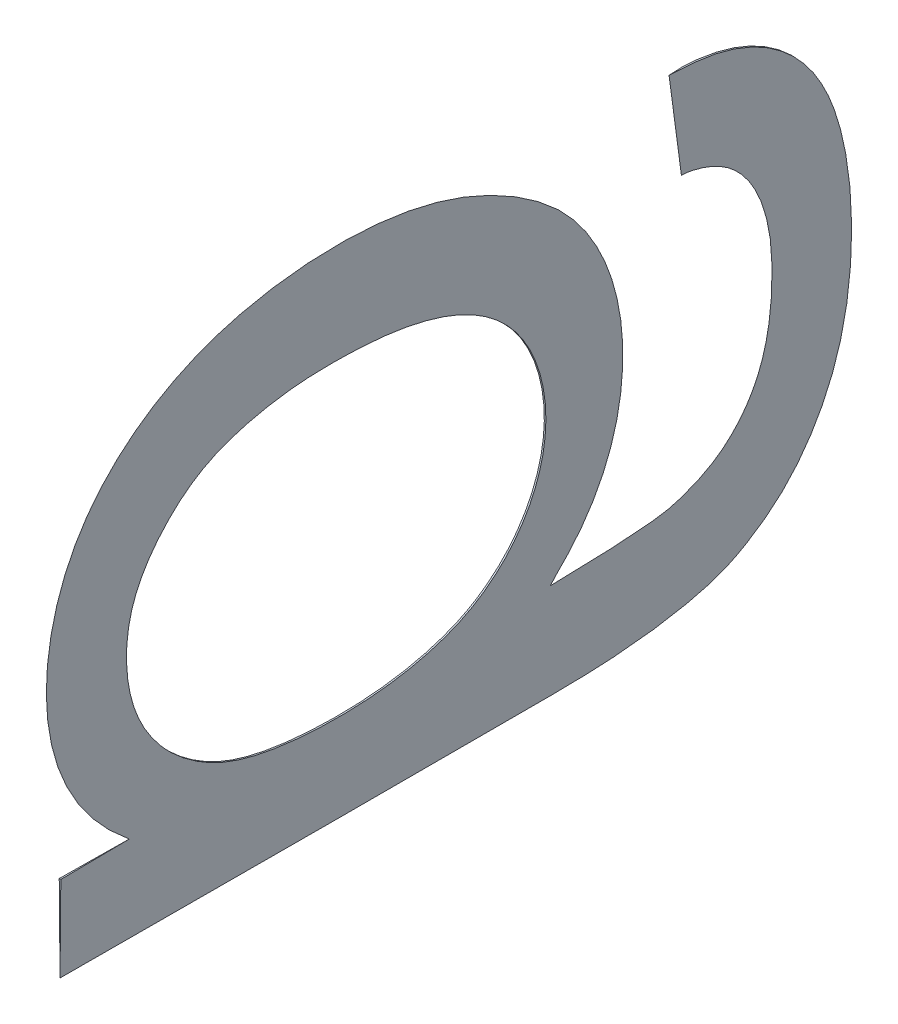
ISO-10303-21;
HEADER;
FILE_DESCRIPTION(('STEP AP214'),'2;1');
FILE_NAME('part.step','',(''),(''),'','','');
FILE_SCHEMA(('AUTOMOTIVE_DESIGN { 1 0 10303 214 1 1 1 1 }'));
ENDSEC;
DATA;
#1=APPLICATION_CONTEXT('core data for automotive mechanical design processes');
#2=APPLICATION_PROTOCOL_DEFINITION('international standard','automotive_design',2000,#1);
#3=PRODUCT_CONTEXT('',#1,'mechanical');
#4=PRODUCT('Part','Part','',(#3));
#5=PRODUCT_RELATED_PRODUCT_CATEGORY('part','',(#4));
#6=PRODUCT_DEFINITION_FORMATION('','',#4);
#7=PRODUCT_DEFINITION_CONTEXT('part definition',#1,'design');
#8=PRODUCT_DEFINITION('design','',#6,#7);
#9=PRODUCT_DEFINITION_SHAPE('','',#8);
#10=(LENGTH_UNIT() NAMED_UNIT(*) SI_UNIT(.MILLI.,.METRE.));
#11=(NAMED_UNIT(*) PLANE_ANGLE_UNIT() SI_UNIT($,.RADIAN.));
#12=(NAMED_UNIT(*) SI_UNIT($,.STERADIAN.) SOLID_ANGLE_UNIT());
#13=UNCERTAINTY_MEASURE_WITH_UNIT(LENGTH_MEASURE(1.E-05),#10,'distance_accuracy_value','');
#14=(GEOMETRIC_REPRESENTATION_CONTEXT(3) GLOBAL_UNCERTAINTY_ASSIGNED_CONTEXT((#13)) GLOBAL_UNIT_ASSIGNED_CONTEXT((#10,
#11,#12)) REPRESENTATION_CONTEXT('',''));
#15=CARTESIAN_POINT('',(0.,0.,0.));
#16=DIRECTION('',(0.,0.,1.));
#17=DIRECTION('',(1.,0.,0.));
#18=AXIS2_PLACEMENT_3D('',#15,#16,#17);
#19=CARTESIAN_POINT('',(-5.56,-17.74356913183,20.699035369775));
#20=DIRECTION('',(0.,0.,1.));
#21=DIRECTION('',(1.,0.,0.));
#22=AXIS2_PLACEMENT_3D('',#19,#20,#21);
#23=PLANE('',#22);
#24=DIRECTION('',(0.,-1.,0.));
#25=VECTOR('',#24,1.);
#26=CARTESIAN_POINT('',(-5.56,-18.17159628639,20.699035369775));
#27=LINE('',#26,#25);
#28=CARTESIAN_POINT('',(-5.555,-18.27733118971,20.699035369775));
#29=VERTEX_POINT('',#28);
#30=CARTESIAN_POINT('',(-5.56,-17.74356913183,20.699035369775));
#31=VERTEX_POINT('',#30);
#32=EDGE_CURVE('E69',#29,#31,#27,.F.);
#33=ORIENTED_EDGE('',*,*,#32,.F.);
#34=DIRECTION('',(0.,-1.,0.));
#35=VECTOR('',#34,1.);
#36=CARTESIAN_POINT('',(-5.55,-18.17159628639,20.699035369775));
#37=LINE('',#36,#35);
#38=CARTESIAN_POINT('',(-5.55,-17.74356913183,20.699035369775));
#39=VERTEX_POINT('',#38);
#40=EDGE_CURVE('E76',#29,#39,#37,.F.);
#41=ORIENTED_EDGE('',*,*,#40,.T.);
#42=DIRECTION('',(-1.,0.,0.));
#43=VECTOR('',#42,1.);
#44=CARTESIAN_POINT('',(-5.56,-17.74356913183,20.699035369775));
#45=LINE('',#44,#43);
#46=EDGE_CURVE('E61',#31,#39,#45,.F.);
#47=ORIENTED_EDGE('',*,*,#46,.F.);
#48=EDGE_LOOP('',(#33,#41,#47));
#49=FACE_BOUND('',#48,.T.);
#50=ADVANCED_FACE('F17',(#49),#23,.T.);
#51=CARTESIAN_POINT('',(-5.56,-17.74356913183,20.268167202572));
#52=DIRECTION('',(0.,1.,0.));
#53=DIRECTION('',(-1.,0.,0.));
#54=AXIS2_PLACEMENT_3D('',#51,#52,#53);
#55=PLANE('',#54);
#56=DIRECTION('',(0.,0.,1.));
#57=VECTOR('',#56,1.);
#58=CARTESIAN_POINT('',(-5.56,-17.74356913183,16.671244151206));
#59=LINE('',#58,#57);
#60=CARTESIAN_POINT('',(-5.555,-17.743569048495,20.268167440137));
#61=VERTEX_POINT('',#60);
#62=EDGE_CURVE('E65',#31,#61,#59,.F.);
#63=ORIENTED_EDGE('',*,*,#62,.F.);
#64=ORIENTED_EDGE('',*,*,#46,.T.);
#65=DIRECTION('',(0.,0.,1.));
#66=VECTOR('',#65,1.);
#67=CARTESIAN_POINT('',(-5.55,-17.74356913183,16.671244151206));
#68=LINE('',#67,#66);
#69=EDGE_CURVE('E64',#39,#61,#68,.F.);
#70=ORIENTED_EDGE('',*,*,#69,.T.);
#71=EDGE_LOOP('',(#63,#64,#70));
#72=FACE_BOUND('',#71,.T.);
#73=ADVANCED_FACE('F63',(#72),#55,.T.);
#74=CARTESIAN_POINT('',(-5.56,-18.17159628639,16.671244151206));
#75=DIRECTION('',(-1.,0.,0.));
#76=DIRECTION('',(0.,-1.,0.));
#77=AXIS2_PLACEMENT_3D('',#74,#75,#76);
#78=PLANE('',#77);
#79=CARTESIAN_POINT('',(-5.56,-15.80466237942,19.007717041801));
#80=CARTESIAN_POINT('',(-5.56,-15.80495361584,18.933886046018));
#81=CARTESIAN_POINT('',(-5.56,-15.81030044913,18.76349559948));
#82=CARTESIAN_POINT('',(-5.56,-15.84513349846,18.487718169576));
#83=CARTESIAN_POINT('',(-5.56,-15.96767723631,18.074812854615));
#84=CARTESIAN_POINT('',(-5.56,-16.31326125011,17.731029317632));
#85=CARTESIAN_POINT('',(-5.56,-16.89464924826,17.630038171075));
#86=CARTESIAN_POINT('',(-5.56,-17.30611635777,17.821288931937));
#87=CARTESIAN_POINT('',(-5.56,-17.52772728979,18.075624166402));
#88=CARTESIAN_POINT('',(-5.56,-17.66159816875,18.337160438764));
#89=CARTESIAN_POINT('',(-5.56,-17.75344367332,18.789555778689));
#90=CARTESIAN_POINT('',(-5.56,-17.71585651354,19.470448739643));
#91=CARTESIAN_POINT('',(-5.56,-17.57753857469,19.810563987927));
#92=CARTESIAN_POINT('',(-5.56,-17.37899507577,20.046874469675));
#93=CARTESIAN_POINT('',(-5.56,-17.14464117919,20.226509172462));
#94=CARTESIAN_POINT('',(-5.56,-16.81739554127,20.314702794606));
#95=CARTESIAN_POINT('',(-5.56,-16.41922193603,20.262414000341));
#96=CARTESIAN_POINT('',(-5.56,-16.0449736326,19.970849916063));
#97=CARTESIAN_POINT('',(-5.56,-15.8933812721,19.686814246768));
#98=CARTESIAN_POINT('',(-5.56,-15.81685638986,19.317723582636));
#99=CARTESIAN_POINT('',(-5.56,-15.80416898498,19.132796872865));
#100=CARTESIAN_POINT('',(-5.56,-15.80466237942,19.007717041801));
#101=B_SPLINE_CURVE_WITH_KNOTS('',3,(#79,#80,#81,#82,#83,#84,#85,#86,#87,#88,#89,#90,#91,#92,
#93,#94,#95,#96,#97,#98,#99,#100),.UNSPECIFIED.,.T.,.F.,(4,1,1,1,1,1,1,1,1,1,1,1,1,1,1,1,1,1,1,
4),(0.,0.02139258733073,0.04278517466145,0.08557034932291,0.171140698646,0.256711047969,
0.342281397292,0.378397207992,0.414513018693,0.486744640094,0.558976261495,0.631207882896,
0.660510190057,0.689812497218,0.748417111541,0.8017246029,0.855032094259,0.927516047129,
0.963758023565,1.),.UNSPECIFIED.);
#102=CARTESIAN_POINT('',(-5.56,-15.8047098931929,18.9986359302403));
#103=VERTEX_POINT('',#102);
#104=EDGE_CURVE('E83',#103,#103,#101,.T.);
#105=ORIENTED_EDGE('',*,*,#104,.F.);
#106=EDGE_LOOP('',(#105));
#107=FACE_BOUND('',#106,.T.);
#108=CARTESIAN_POINT('',(-5.56,-17.68890650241,17.647587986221));
#109=CARTESIAN_POINT('',(-5.56,-17.6889068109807,17.3973414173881));
#110=CARTESIAN_POINT('',(-5.56,-17.6814941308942,17.2402048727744));
#111=CARTESIAN_POINT('',(-5.56,-17.6690179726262,16.9757309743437));
#112=CARTESIAN_POINT('',(-5.56,-17.6402882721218,16.8751682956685));
#113=CARTESIAN_POINT('',(-5.56,-17.5855437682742,16.6835459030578));
#114=CARTESIAN_POINT('',(-5.56,-17.4869549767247,16.5630641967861));
#115=CARTESIAN_POINT('',(-5.56,-17.3806855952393,16.4331963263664));
#116=CARTESIAN_POINT('',(-5.56,-17.2263921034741,16.359913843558));
#117=CARTESIAN_POINT('',(-5.56,-17.0651673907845,16.2833393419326));
#118=CARTESIAN_POINT('',(-5.56,-16.833752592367,16.2665897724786));
#119=CARTESIAN_POINT('',(-5.56,-16.5657420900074,16.2471914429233));
#120=CARTESIAN_POINT('',(-5.56,-16.3709903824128,16.2999195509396));
#121=CARTESIAN_POINT('',(-5.56,-16.1561313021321,16.3580916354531));
#122=CARTESIAN_POINT('',(-5.56,-16.0321635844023,16.4894310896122));
#123=CARTESIAN_POINT('',(-5.56,-15.9112466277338,16.6175383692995));
#124=CARTESIAN_POINT('',(-5.56,-15.88504823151,16.830868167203));
#125=B_SPLINE_CURVE_WITH_KNOTS('',2,(#108,#109,#110,#111,#112,#113,#114,#115,#116,#117,#118,
#119,#120,#121,#122,#123,#124),.UNSPECIFIED.,.F.,.F.,(3,2,2,2,2,2,2,2,3),(0.,0.1,0.25,0.375,0.5,
0.625,0.75,0.875,1.),.UNSPECIFIED.);
#126=CARTESIAN_POINT('',(-5.555,-17.68890650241,17.647587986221));
#127=VERTEX_POINT('',#126);
#128=CARTESIAN_POINT('',(-5.555,-15.88504815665,16.8308680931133));
#129=VERTEX_POINT('',#128);
#130=EDGE_CURVE('E213',#127,#129,#125,.T.);
#131=ORIENTED_EDGE('',*,*,#130,.T.);
#132=DIRECTION('',(0.,-0.991227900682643,-0.132163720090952));
#133=VECTOR('',#132,1.);
#134=CARTESIAN_POINT('',(-5.56,-15.30627009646,16.908038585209));
#135=LINE('',#134,#133);
#136=CARTESIAN_POINT('',(-5.555,-15.3062700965,16.9080385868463));
#137=VERTEX_POINT('',#136);
#138=EDGE_CURVE('E43',#137,#129,#135,.T.);
#139=ORIENTED_EDGE('',*,*,#138,.F.);
#140=CARTESIAN_POINT('',(-5.56,-18.27733118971,20.699035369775));
#141=CARTESIAN_POINT('',(-5.56,-18.27733118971,20.368399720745));
#142=CARTESIAN_POINT('',(-5.56,-18.27734943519,19.707862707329));
#143=CARTESIAN_POINT('',(-5.56,-18.27728101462,18.878520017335));
#144=CARTESIAN_POINT('',(-5.56,-18.27740075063,18.30472637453));
#145=CARTESIAN_POINT('',(-5.56,-18.27720917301,17.966380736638));
#146=CARTESIAN_POINT('',(-5.56,-18.27779758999,17.742084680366));
#147=CARTESIAN_POINT('',(-5.56,-18.27558760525,17.405167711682));
#148=CARTESIAN_POINT('',(-5.56,-18.25062037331,17.022706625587));
#149=CARTESIAN_POINT('',(-5.56,-18.19131823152,16.710862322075));
#150=CARTESIAN_POINT('',(-5.56,-18.11732685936,16.514046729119));
#151=CARTESIAN_POINT('',(-5.56,-17.95906842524,16.251457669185));
#152=CARTESIAN_POINT('',(-5.56,-17.69521972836,16.012165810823));
#153=CARTESIAN_POINT('',(-5.56,-17.25481257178,15.813953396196));
#154=CARTESIAN_POINT('',(-5.56,-16.67692791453,15.754825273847));
#155=CARTESIAN_POINT('',(-5.56,-16.10806071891,15.82418115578));
#156=CARTESIAN_POINT('',(-5.56,-15.52727937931,16.081636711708));
#157=CARTESIAN_POINT('',(-5.56,-15.2964146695,16.520391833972));
#158=CARTESIAN_POINT('',(-5.56,-15.30627009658,16.908038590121));
#159=B_SPLINE_CURVE_WITH_KNOTS('',3,(#140,#141,#142,#143,#144,#145,#146,#147,#148,#149,#150,
#151,#152,#153,#154,#155,#156,#157,#158),.UNSPECIFIED.,.F.,.F.,(4,1,1,1,1,1,1,1,1,1,1,1,1,1,1,1,
4),(0.606665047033,0.655831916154,0.704998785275,0.729582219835,0.741873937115,0.754165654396,
0.766457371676,0.778749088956,0.803332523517,0.815624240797,0.827915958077,0.852499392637,
0.877082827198,0.901666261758,0.926249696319,0.950833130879,1.),.UNSPECIFIED.);
#160=EDGE_CURVE('E86',#29,#137,#159,.T.);
#161=ORIENTED_EDGE('',*,*,#160,.F.);
#162=ORIENTED_EDGE('',*,*,#32,.T.);
#163=ORIENTED_EDGE('',*,*,#62,.T.);
#164=CARTESIAN_POINT('',(-5.56,-17.74356913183,20.268167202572));
#165=CARTESIAN_POINT('',(-5.56,-17.5796275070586,20.4730942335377));
#166=CARTESIAN_POINT('',(-5.56,-17.372461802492,20.5978323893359));
#167=CARTESIAN_POINT('',(-5.56,-17.1712452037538,20.7189884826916));
#168=CARTESIAN_POINT('',(-5.56,-16.9359162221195,20.7594616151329));
#169=CARTESIAN_POINT('',(-5.56,-16.7047982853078,20.799210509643));
#170=CARTESIAN_POINT('',(-5.56,-16.4610704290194,20.7597560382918));
#171=CARTESIAN_POINT('',(-5.56,-16.2184072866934,20.7204739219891));
#172=CARTESIAN_POINT('',(-5.56,-16.0123971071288,20.6096182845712));
#173=CARTESIAN_POINT('',(-5.56,-15.8125114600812,20.5020583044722));
#174=CARTESIAN_POINT('',(-5.56,-15.6522305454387,20.3257662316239));
#175=CARTESIAN_POINT('',(-5.56,-15.5008455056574,20.159258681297));
#176=CARTESIAN_POINT('',(-5.56,-15.397016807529,19.9439772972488));
#177=CARTESIAN_POINT('',(-5.56,-15.2991589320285,19.7410759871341));
#178=CARTESIAN_POINT('',(-5.56,-15.2477350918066,19.4965350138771));
#179=CARTESIAN_POINT('',(-5.56,-15.1968306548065,19.2544640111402));
#180=CARTESIAN_POINT('',(-5.56,-15.193910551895,18.9978749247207));
#181=CARTESIAN_POINT('',(-5.56,-15.1880275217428,18.480933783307));
#182=CARTESIAN_POINT('',(-5.56,-15.3731614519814,18.0763668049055));
#183=CARTESIAN_POINT('',(-5.56,-15.4926129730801,17.8153333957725));
#184=CARTESIAN_POINT('',(-5.56,-15.6591233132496,17.6275879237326));
#185=CARTESIAN_POINT('',(-5.56,-15.7804569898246,17.4907805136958));
#186=CARTESIAN_POINT('',(-5.56,-15.9364167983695,17.3951277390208));
#187=CARTESIAN_POINT('',(-5.56,-16.1293600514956,17.2767923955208));
#188=CARTESIAN_POINT('',(-5.56,-16.3542608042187,17.2263146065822));
#189=CARTESIAN_POINT('',(-5.56,-16.5919109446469,17.1729752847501));
#190=CARTESIAN_POINT('',(-5.56,-16.8373776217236,17.1993887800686));
#191=CARTESIAN_POINT('',(-5.56,-17.0842313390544,17.2259515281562));
#192=CARTESIAN_POINT('',(-5.56,-17.2964540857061,17.335185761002));
#193=CARTESIAN_POINT('',(-5.56,-17.517428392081,17.4489245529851));
#194=CARTESIAN_POINT('',(-5.56,-17.68890650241,17.647587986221));
#195=B_SPLINE_CURVE_WITH_KNOTS('',2,(#164,#165,#166,#167,#168,#169,#170,#171,#172,#173,#174,
#175,#176,#177,#178,#179,#180,#181,#182,#183,#184,#185,#186,#187,#188,#189,#190,#191,#192,#193,
#194),.UNSPECIFIED.,.F.,.F.,(3,2,2,2,2,2,2,2,2,2,2,2,2,2,2,3),(0.,0.0625,0.125,0.1875,0.25,
0.3125,0.375,0.4375,0.5,0.625,0.696428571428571,0.75,0.8125,0.875,0.9375,1.),.UNSPECIFIED.);
#196=EDGE_CURVE('E78',#61,#127,#195,.T.);
#197=ORIENTED_EDGE('',*,*,#196,.T.);
#198=EDGE_LOOP('',(#131,#139,#161,#162,#163,#197));
#199=FACE_BOUND('',#198,.T.);
#200=ADVANCED_FACE('F100',(#107,#199),#78,.T.);
#201=CARTESIAN_POINT('',(-5.56,-15.30627009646,16.908038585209));
#202=DIRECTION('',(0.,-0.132163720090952,0.991227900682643));
#203=DIRECTION('',(0.,-0.991227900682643,-0.132163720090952));
#204=AXIS2_PLACEMENT_3D('',#201,#202,#203);
#205=PLANE('',#204);
#206=ORIENTED_EDGE('',*,*,#138,.T.);
#207=DIRECTION('',(0.,0.99122786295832,0.13216400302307));
#208=VECTOR('',#207,1.);
#209=CARTESIAN_POINT('',(-5.55,-15.88504808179,16.830868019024));
#210=LINE('',#209,#208);
#211=EDGE_CURVE('E206',#129,#137,#210,.T.);
#212=ORIENTED_EDGE('',*,*,#211,.T.);
#213=EDGE_LOOP('',(#206,#212));
#214=FACE_BOUND('',#213,.T.);
#215=ADVANCED_FACE('F110',(#214),#205,.T.);
#216=CARTESIAN_POINT('',(-5.55,-15.30627009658,16.908038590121));
#217=CARTESIAN_POINT('',(-5.56,-15.30627009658,16.908038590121));
#218=CARTESIAN_POINT('',(-5.55,-15.2964146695,16.520391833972));
#219=CARTESIAN_POINT('',(-5.56,-15.2964146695,16.520391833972));
#220=CARTESIAN_POINT('',(-5.55,-15.52727937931,16.081636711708));
#221=CARTESIAN_POINT('',(-5.56,-15.52727937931,16.081636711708));
#222=CARTESIAN_POINT('',(-5.55,-16.10806071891,15.82418115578));
#223=CARTESIAN_POINT('',(-5.56,-16.10806071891,15.82418115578));
#224=CARTESIAN_POINT('',(-5.55,-16.67692791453,15.754825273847));
#225=CARTESIAN_POINT('',(-5.56,-16.67692791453,15.754825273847));
#226=CARTESIAN_POINT('',(-5.55,-17.25481257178,15.813953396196));
#227=CARTESIAN_POINT('',(-5.56,-17.25481257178,15.813953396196));
#228=CARTESIAN_POINT('',(-5.55,-17.69521972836,16.012165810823));
#229=CARTESIAN_POINT('',(-5.56,-17.69521972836,16.012165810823));
#230=CARTESIAN_POINT('',(-5.55,-17.95906842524,16.251457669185));
#231=CARTESIAN_POINT('',(-5.56,-17.95906842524,16.251457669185));
#232=CARTESIAN_POINT('',(-5.55,-18.11732685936,16.514046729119));
#233=CARTESIAN_POINT('',(-5.56,-18.11732685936,16.514046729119));
#234=CARTESIAN_POINT('',(-5.55,-18.19131823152,16.710862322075));
#235=CARTESIAN_POINT('',(-5.56,-18.19131823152,16.710862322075));
#236=CARTESIAN_POINT('',(-5.55,-18.25062037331,17.022706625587));
#237=CARTESIAN_POINT('',(-5.56,-18.25062037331,17.022706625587));
#238=CARTESIAN_POINT('',(-5.55,-18.27558760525,17.405167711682));
#239=CARTESIAN_POINT('',(-5.56,-18.27558760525,17.405167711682));
#240=CARTESIAN_POINT('',(-5.55,-18.27779758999,17.742084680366));
#241=CARTESIAN_POINT('',(-5.56,-18.27779758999,17.742084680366));
#242=CARTESIAN_POINT('',(-5.55,-18.27720917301,17.966380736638));
#243=CARTESIAN_POINT('',(-5.56,-18.27720917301,17.966380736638));
#244=CARTESIAN_POINT('',(-5.55,-18.27740075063,18.30472637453));
#245=CARTESIAN_POINT('',(-5.56,-18.27740075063,18.30472637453));
#246=CARTESIAN_POINT('',(-5.55,-18.27728101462,18.878520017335));
#247=CARTESIAN_POINT('',(-5.56,-18.27728101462,18.878520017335));
#248=CARTESIAN_POINT('',(-5.55,-18.27734943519,19.707862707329));
#249=CARTESIAN_POINT('',(-5.56,-18.27734943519,19.707862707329));
#250=CARTESIAN_POINT('',(-5.55,-18.27733118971,20.368399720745));
#251=CARTESIAN_POINT('',(-5.56,-18.27733118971,20.368399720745));
#252=CARTESIAN_POINT('',(-5.55,-18.27733118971,20.699035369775));
#253=CARTESIAN_POINT('',(-5.56,-18.27733118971,20.699035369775));
#254=B_SPLINE_SURFACE_WITH_KNOTS('',3,1,((#216,#217),(#218,#219),(#220,#221),(#222,#223),(#224,
#225),(#226,#227),(#228,#229),(#230,#231),(#232,#233),(#234,#235),(#236,#237),(#238,#239),(#240,
#241),(#242,#243),(#244,#245),(#246,#247),(#248,#249),(#250,#251),(#252,#253)),.UNSPECIFIED.,
.F.,.F.,.F.,(4,1,1,1,1,1,1,1,1,1,1,1,1,1,1,1,4),(2,2),(0.606665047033,0.655831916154,
0.680415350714,0.704998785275,0.729582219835,0.754165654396,0.778749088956,0.791040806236,
0.803332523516,0.827915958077,0.840207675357,0.852499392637,0.864791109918,0.877082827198,
0.901666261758,0.950833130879,1.),(0.,1.),.UNSPECIFIED.);
#255=CARTESIAN_POINT('',(-5.55,-15.3062700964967,16.9080385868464));
#256=CARTESIAN_POINT('',(-5.55,-15.306100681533,16.9013739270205));
#257=CARTESIAN_POINT('',(-5.55,-15.3059788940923,16.8947079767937));
#258=CARTESIAN_POINT('',(-5.55,-15.3056125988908,16.8613638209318));
#259=CARTESIAN_POINT('',(-5.55,-15.3060970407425,16.8346760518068));
#260=CARTESIAN_POINT('',(-5.55,-15.3100653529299,16.7546159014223));
#261=CARTESIAN_POINT('',(-5.55,-15.3160712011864,16.7013389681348));
#262=CARTESIAN_POINT('',(-5.55,-15.3356779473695,16.5961048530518));
#263=CARTESIAN_POINT('',(-5.55,-15.349283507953,16.544148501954));
#264=CARTESIAN_POINT('',(-5.55,-15.3757148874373,16.4684220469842));
#265=CARTESIAN_POINT('',(-5.55,-15.38551654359,16.4435713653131));
#266=CARTESIAN_POINT('',(-5.55,-15.4071372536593,16.3947544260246));
#267=CARTESIAN_POINT('',(-5.55,-15.4189564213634,16.3707882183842));
#268=CARTESIAN_POINT('',(-5.55,-15.4445808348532,16.3239415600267));
#269=CARTESIAN_POINT('',(-5.55,-15.4583861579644,16.3010611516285));
#270=CARTESIAN_POINT('',(-5.55,-15.4879119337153,16.2565668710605));
#271=CARTESIAN_POINT('',(-5.55,-15.503632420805,16.2349530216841));
#272=CARTESIAN_POINT('',(-5.55,-15.5368644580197,16.1931614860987));
#273=CARTESIAN_POINT('',(-5.55,-15.5543760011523,16.1729837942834));
#274=CARTESIAN_POINT('',(-5.55,-15.6093108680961,16.114905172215));
#275=CARTESIAN_POINT('',(-5.55,-15.6492373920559,16.0793042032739));
#276=CARTESIAN_POINT('',(-5.55,-15.7128897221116,16.0312049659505));
#277=CARTESIAN_POINT('',(-5.55,-15.7347018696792,16.0160726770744));
#278=CARTESIAN_POINT('',(-5.55,-15.7794215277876,15.9875208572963));
#279=CARTESIAN_POINT('',(-5.55,-15.8023289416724,15.9741011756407));
#280=CARTESIAN_POINT('',(-5.55,-15.8724796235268,15.9363026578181));
#281=CARTESIAN_POINT('',(-5.55,-15.921084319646,15.9144338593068));
#282=CARTESIAN_POINT('',(-5.55,-16.0204059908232,15.8765513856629));
#283=CARTESIAN_POINT('',(-5.55,-16.0711212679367,15.8605331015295));
#284=CARTESIAN_POINT('',(-5.55,-16.1480598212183,15.8400492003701));
#285=CARTESIAN_POINT('',(-5.55,-16.1738342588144,15.833814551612));
#286=CARTESIAN_POINT('',(-5.55,-16.2515422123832,15.8166954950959));
#287=CARTESIAN_POINT('',(-5.55,-16.303834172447,15.8074040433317));
#288=CARTESIAN_POINT('',(-5.55,-16.4089077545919,15.792507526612));
#289=CARTESIAN_POINT('',(-5.55,-16.461689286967,15.7869017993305));
#290=CARTESIAN_POINT('',(-5.55,-16.5675023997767,15.7790780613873));
#291=CARTESIAN_POINT('',(-5.55,-16.6205339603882,15.7768597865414));
#292=CARTESIAN_POINT('',(-5.55,-16.7000831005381,15.776001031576));
#293=CARTESIAN_POINT('',(-5.55,-16.7265947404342,15.7761259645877));
#294=CARTESIAN_POINT('',(-5.55,-16.8061334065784,15.7777472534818));
#295=CARTESIAN_POINT('',(-5.55,-16.8591433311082,15.7804909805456));
#296=CARTESIAN_POINT('',(-5.55,-16.9648632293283,15.78953532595));
#297=CARTESIAN_POINT('',(-5.55,-17.0175731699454,15.795836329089));
#298=CARTESIAN_POINT('',(-5.55,-17.122400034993,15.8124876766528));
#299=CARTESIAN_POINT('',(-5.55,-17.1745168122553,15.8228390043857));
#300=CARTESIAN_POINT('',(-5.55,-17.2517387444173,15.8420619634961));
#301=CARTESIAN_POINT('',(-5.55,-17.2773134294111,15.8490831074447));
#302=CARTESIAN_POINT('',(-5.55,-17.3535336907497,15.872095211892));
#303=CARTESIAN_POINT('',(-5.55,-17.4036219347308,15.890024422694));
#304=CARTESIAN_POINT('',(-5.55,-17.477041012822,15.9208169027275));
#305=CARTESIAN_POINT('',(-5.55,-17.5012172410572,15.9317246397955));
#306=CARTESIAN_POINT('',(-5.55,-17.5728776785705,15.9664443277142));
#307=CARTESIAN_POINT('',(-5.55,-17.6194355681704,15.992232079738));
#308=CARTESIAN_POINT('',(-5.55,-17.686844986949,16.0346364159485));
#309=CARTESIAN_POINT('',(-5.55,-17.7088986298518,16.0493824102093));
#310=CARTESIAN_POINT('',(-5.55,-17.7520773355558,16.0801810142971));
#311=CARTESIAN_POINT('',(-5.55,-17.773202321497,16.0962337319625));
#312=CARTESIAN_POINT('',(-5.55,-17.835016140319,16.1465347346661));
#313=CARTESIAN_POINT('',(-5.55,-17.8740602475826,16.1828745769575));
#314=CARTESIAN_POINT('',(-5.55,-17.9283968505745,16.2411681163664));
#315=CARTESIAN_POINT('',(-5.55,-17.9457910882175,16.26121122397));
#316=CARTESIAN_POINT('',(-5.55,-17.9958490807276,16.3231939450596));
#317=CARTESIAN_POINT('',(-5.55,-18.0263260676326,16.3669290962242));
#318=CARTESIAN_POINT('',(-5.55,-18.0681216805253,16.4347722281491));
#319=CARTESIAN_POINT('',(-5.55,-18.0813901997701,16.4577386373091));
#320=CARTESIAN_POINT('',(-5.55,-18.1064519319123,16.5044983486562));
#321=CARTESIAN_POINT('',(-5.55,-18.1182447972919,16.5282918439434));
#322=CARTESIAN_POINT('',(-5.55,-18.1342750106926,16.5647188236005));
#323=CARTESIAN_POINT('',(-5.55,-18.1393431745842,16.576987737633));
#324=CARTESIAN_POINT('',(-5.55,-18.14890587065,16.601747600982));
#325=CARTESIAN_POINT('',(-5.55,-18.1534003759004,16.6142385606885));
#326=CARTESIAN_POINT('',(-5.55,-18.1618799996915,16.6393804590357));
#327=CARTESIAN_POINT('',(-5.55,-18.1658654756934,16.6520312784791));
#328=CARTESIAN_POINT('',(-5.55,-18.1734694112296,16.6774428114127));
#329=CARTESIAN_POINT('',(-5.55,-18.177087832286,16.6902035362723));
#330=CARTESIAN_POINT('',(-5.55,-18.1874912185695,16.7286141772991));
#331=CARTESIAN_POINT('',(-5.55,-18.1938226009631,16.7543872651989));
#332=CARTESIAN_POINT('',(-5.55,-18.2055279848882,16.8061505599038));
#333=CARTESIAN_POINT('',(-5.55,-18.2109018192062,16.8321408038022));
#334=CARTESIAN_POINT('',(-5.55,-18.2208351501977,16.8842484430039));
#335=CARTESIAN_POINT('',(-5.55,-18.2253954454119,16.9103656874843));
#336=CARTESIAN_POINT('',(-5.55,-18.2380208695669,16.9889003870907));
#337=CARTESIAN_POINT('',(-5.55,-18.2450281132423,17.0414896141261));
#338=CARTESIAN_POINT('',(-5.55,-18.2566265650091,17.1469193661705));
#339=CARTESIAN_POINT('',(-5.55,-18.261217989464,17.1997598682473));
#340=CARTESIAN_POINT('',(-5.55,-18.268385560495,17.3055686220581));
#341=CARTESIAN_POINT('',(-5.55,-18.2709618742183,17.358536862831));
#342=CARTESIAN_POINT('',(-5.55,-18.2745740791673,17.4645152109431));
#343=CARTESIAN_POINT('',(-5.55,-18.2756100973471,17.5175253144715));
#344=CARTESIAN_POINT('',(-5.55,-18.2765968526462,17.5970425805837));
#345=CARTESIAN_POINT('',(-5.55,-18.2768312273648,17.6235478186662));
#346=CARTESIAN_POINT('',(-5.55,-18.2773532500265,17.7030648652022));
#347=CARTESIAN_POINT('',(-5.55,-18.2774597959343,17.7560779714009));
#348=CARTESIAN_POINT('',(-5.55,-18.2774742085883,17.862103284));
#349=CARTESIAN_POINT('',(-5.55,-18.2773820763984,17.9151154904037));
#350=CARTESIAN_POINT('',(-5.55,-18.2773102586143,17.9946339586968));
#351=CARTESIAN_POINT('',(-5.55,-18.2772973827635,18.0211401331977));
#352=CARTESIAN_POINT('',(-5.55,-18.277284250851,18.1006586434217));
#353=CARTESIAN_POINT('',(-5.55,-18.2773094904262,18.1536709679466));
#354=CARTESIAN_POINT('',(-5.55,-18.2773359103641,18.2331894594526));
#355=CARTESIAN_POINT('',(-5.55,-18.2773428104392,18.2596956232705));
#356=CARTESIAN_POINT('',(-5.55,-18.2773578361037,18.3392141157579));
#357=CARTESIAN_POINT('',(-5.55,-18.2773602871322,18.3922264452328));
#358=CARTESIAN_POINT('',(-5.55,-18.2773578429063,18.471744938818));
#359=CARTESIAN_POINT('',(-5.55,-18.2773560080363,18.4982511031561));
#360=CARTESIAN_POINT('',(-5.55,-18.277348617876,18.5777695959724));
#361=CARTESIAN_POINT('',(-5.55,-18.2773411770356,18.630781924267));
#362=CARTESIAN_POINT('',(-5.55,-18.2773316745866,18.710300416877));
#363=CARTESIAN_POINT('',(-5.55,-18.2773287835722,18.7368065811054));
#364=CARTESIAN_POINT('',(-5.55,-18.2773213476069,18.816325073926));
#365=CARTESIAN_POINT('',(-5.55,-18.2773180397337,18.8693374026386));
#366=CARTESIAN_POINT('',(-5.55,-18.2773137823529,18.9753620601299));
#367=CARTESIAN_POINT('',(-5.55,-18.2773128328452,19.0283743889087));
#368=CARTESIAN_POINT('',(-5.55,-18.2773127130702,19.10789288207));
#369=CARTESIAN_POINT('',(-5.55,-18.2773128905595,19.1343990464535));
#370=CARTESIAN_POINT('',(-5.55,-18.2773139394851,19.2139175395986));
#371=CARTESIAN_POINT('',(-5.55,-18.2773153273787,19.266929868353));
#372=CARTESIAN_POINT('',(-5.55,-18.2773179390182,19.3464483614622));
#373=CARTESIAN_POINT('',(-5.55,-18.2773188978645,19.3729545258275));
#374=CARTESIAN_POINT('',(-5.55,-18.2773219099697,19.452473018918));
#375=CARTESIAN_POINT('',(-5.55,-18.2773240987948,19.5054853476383));
#376=CARTESIAN_POINT('',(-5.55,-18.2773271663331,19.5850038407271));
#377=CARTESIAN_POINT('',(-5.55,-18.277328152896,19.6115100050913));
#378=CARTESIAN_POINT('',(-5.55,-18.2773308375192,19.6910284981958));
#379=CARTESIAN_POINT('',(-5.55,-18.2773322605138,19.744040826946));
#380=CARTESIAN_POINT('',(-5.55,-18.277333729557,19.8235593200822));
#381=CARTESIAN_POINT('',(-5.55,-18.2773341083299,19.8500654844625));
#382=CARTESIAN_POINT('',(-5.55,-18.2773346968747,19.9030778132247));
#383=CARTESIAN_POINT('',(-5.55,-18.2773349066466,19.9295839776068));
#384=CARTESIAN_POINT('',(-5.55,-18.2773351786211,19.9825963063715));
#385=CARTESIAN_POINT('',(-5.55,-18.2773352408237,20.0091024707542));
#386=CARTESIAN_POINT('',(-5.55,-18.2773352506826,20.0886209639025));
#387=CARTESIAN_POINT('',(-5.55,-18.2773350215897,20.141633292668));
#388=CARTESIAN_POINT('',(-5.55,-18.2773344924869,20.2211517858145));
#389=CARTESIAN_POINT('',(-5.55,-18.2773342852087,20.2476579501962));
#390=CARTESIAN_POINT('',(-5.55,-18.2773338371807,20.3006702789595));
#391=CARTESIAN_POINT('',(-5.55,-18.2773335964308,20.327176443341));
#392=CARTESIAN_POINT('',(-5.55,-18.2773331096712,20.3801887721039));
#393=CARTESIAN_POINT('',(-5.55,-18.2773328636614,20.4066949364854));
#394=CARTESIAN_POINT('',(-5.55,-18.2773318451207,20.521812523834));
#395=CARTESIAN_POINT('',(-5.55000000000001,-18.2773311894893,20.6104239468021));
#396=CARTESIAN_POINT('',(-5.55,-18.27733118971,20.699035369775));
#397=B_SPLINE_CURVE_WITH_KNOTS('',3,(#255,#256,#257,#258,#259,#260,#261,#262,#263,#264,#265,
#266,#267,#268,#269,#270,#271,#272,#273,#274,#275,#276,#277,#278,#279,#280,#281,#282,#283,#284,
#285,#286,#287,#288,#289,#290,#291,#292,#293,#294,#295,#296,#297,#298,#299,#300,#301,#302,#303,
#304,#305,#306,#307,#308,#309,#310,#311,#312,#313,#314,#315,#316,#317,#318,#319,#320,#321,#322,
#323,#324,#325,#326,#327,#328,#329,#330,#331,#332,#333,#334,#335,#336,#337,#338,#339,#340,#341,
#342,#343,#344,#345,#346,#347,#348,#349,#350,#351,#352,#353,#354,#355,#356,#357,#358,#359,#360,
#361,#362,#363,#364,#365,#366,#367,#368,#369,#370,#371,#372,#373,#374,#375,#376,#377,#378,#379,
#380,#381,#382,#383,#384,#385,#386,#387,#388,#389,#390,#391,#392,#393,#394,#395,#396),
.UNSPECIFIED.,.F.,.F.,(4,2,2,2,2,2,2,2,2,2,2,2,2,2,2,2,2,2,2,2,2,2,2,2,2,2,2,2,2,2,2,2,2,2,2,2,
2,2,2,2,2,2,2,2,2,2,2,2,2,2,2,2,2,2,2,2,2,2,2,2,2,2,2,2,2,2,2,2,2,2,4),(0.,0.0200005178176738,
0.100036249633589,0.260383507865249,0.420829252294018,0.50089412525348,0.580963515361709,
0.661036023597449,0.741109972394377,0.821183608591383,0.980780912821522,1.06036220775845,
1.13993649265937,1.29933250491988,1.45860267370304,1.53814057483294,1.69729835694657,
1.8564275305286,2.01554429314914,2.09507244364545,2.25419124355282,2.413327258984,
2.57250193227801,2.65204436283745,2.81129219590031,2.890839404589,3.050117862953,
3.12966863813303,3.20922598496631,3.36863280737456,3.44820061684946,3.60758845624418,
3.68714132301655,3.76671288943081,3.80652260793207,3.84633419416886,3.88611766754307,
3.92590530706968,4.00549725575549,4.08510308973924,4.16463035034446,4.32371918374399,
4.48279376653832,4.64185515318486,4.80090342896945,4.88042235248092,5.03946030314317,
5.19849740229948,5.27801590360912,5.43705289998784,5.51657139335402,5.67560838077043,
5.7551268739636,5.91416386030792,5.99368235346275,6.15271933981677,6.31175632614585,
6.39127481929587,6.55031180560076,6.6298302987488,6.78886728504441,6.86838577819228,
7.02742276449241,7.10694125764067,7.18645975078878,7.26597824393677,7.42501523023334,
7.5045337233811,7.58405221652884,7.66357070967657,7.92940497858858),.UNSPECIFIED.);
#398=EDGE_CURVE('E35',#137,#29,#397,.T.);
#399=ORIENTED_EDGE('',*,*,#160,.T.);
#400=ORIENTED_EDGE('',*,*,#398,.T.);
#401=EDGE_LOOP('',(#399,#400));
#402=FACE_BOUND('',#401,.T.);
#403=ADVANCED_FACE('F167',(#402),#254,.T.);
#404=CARTESIAN_POINT('',(-5.56,-15.80466237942,19.007717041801));
#405=CARTESIAN_POINT('',(-5.55,-15.80466237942,19.007717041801));
#406=CARTESIAN_POINT('',(-5.56,-15.80495361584,18.933886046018));
#407=CARTESIAN_POINT('',(-5.55,-15.80495361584,18.933886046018));
#408=CARTESIAN_POINT('',(-5.56,-15.81030044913,18.76349559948));
#409=CARTESIAN_POINT('',(-5.55,-15.81030044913,18.76349559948));
#410=CARTESIAN_POINT('',(-5.56,-15.84513349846,18.487718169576));
#411=CARTESIAN_POINT('',(-5.55,-15.84513349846,18.487718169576));
#412=CARTESIAN_POINT('',(-5.56,-15.96767723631,18.074812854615));
#413=CARTESIAN_POINT('',(-5.55,-15.96767723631,18.074812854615));
#414=CARTESIAN_POINT('',(-5.56,-16.31326125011,17.731029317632));
#415=CARTESIAN_POINT('',(-5.55,-16.31326125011,17.731029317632));
#416=CARTESIAN_POINT('',(-5.56,-16.89464924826,17.630038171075));
#417=CARTESIAN_POINT('',(-5.55,-16.89464924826,17.630038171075));
#418=CARTESIAN_POINT('',(-5.56,-17.30611635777,17.821288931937));
#419=CARTESIAN_POINT('',(-5.55,-17.30611635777,17.821288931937));
#420=CARTESIAN_POINT('',(-5.56,-17.52772728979,18.075624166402));
#421=CARTESIAN_POINT('',(-5.55,-17.52772728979,18.075624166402));
#422=CARTESIAN_POINT('',(-5.56,-17.66159816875,18.337160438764));
#423=CARTESIAN_POINT('',(-5.55,-17.66159816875,18.337160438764));
#424=CARTESIAN_POINT('',(-5.56,-17.75344367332,18.789555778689));
#425=CARTESIAN_POINT('',(-5.55,-17.75344367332,18.789555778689));
#426=CARTESIAN_POINT('',(-5.56,-17.71585651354,19.470448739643));
#427=CARTESIAN_POINT('',(-5.55,-17.71585651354,19.470448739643));
#428=CARTESIAN_POINT('',(-5.56,-17.57753857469,19.810563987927));
#429=CARTESIAN_POINT('',(-5.55,-17.57753857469,19.810563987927));
#430=CARTESIAN_POINT('',(-5.56,-17.37899507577,20.046874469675));
#431=CARTESIAN_POINT('',(-5.55,-17.37899507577,20.046874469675));
#432=CARTESIAN_POINT('',(-5.56,-17.14464117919,20.226509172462));
#433=CARTESIAN_POINT('',(-5.55,-17.14464117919,20.226509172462));
#434=CARTESIAN_POINT('',(-5.56,-16.81739554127,20.314702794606));
#435=CARTESIAN_POINT('',(-5.55,-16.81739554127,20.314702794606));
#436=CARTESIAN_POINT('',(-5.56,-16.41922193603,20.262414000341));
#437=CARTESIAN_POINT('',(-5.55,-16.41922193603,20.262414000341));
#438=CARTESIAN_POINT('',(-5.56,-16.0449736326,19.970849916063));
#439=CARTESIAN_POINT('',(-5.55,-16.0449736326,19.970849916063));
#440=CARTESIAN_POINT('',(-5.56,-15.8933812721,19.686814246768));
#441=CARTESIAN_POINT('',(-5.55,-15.8933812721,19.686814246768));
#442=CARTESIAN_POINT('',(-5.56,-15.81685638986,19.317723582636));
#443=CARTESIAN_POINT('',(-5.55,-15.81685638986,19.317723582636));
#444=CARTESIAN_POINT('',(-5.56,-15.80416898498,19.132796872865));
#445=CARTESIAN_POINT('',(-5.55,-15.80416898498,19.132796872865));
#446=CARTESIAN_POINT('',(-5.56,-15.80466237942,19.007717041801));
#447=CARTESIAN_POINT('',(-5.55,-15.80466237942,19.007717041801));
#448=B_SPLINE_SURFACE_WITH_KNOTS('',3,1,((#404,#405),(#406,#407),(#408,#409),(#410,#411),(#412,
#413),(#414,#415),(#416,#417),(#418,#419),(#420,#421),(#422,#423),(#424,#425),(#426,#427),(#428,
#429),(#430,#431),(#432,#433),(#434,#435),(#436,#437),(#438,#439),(#440,#441),(#442,#443),(#444,
#445),(#446,#447)),.UNSPECIFIED.,.T.,.F.,.F.,(4,1,1,1,1,1,1,1,1,1,1,1,1,1,1,1,1,1,1,4),(2,2),
(0.,0.02139258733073,0.04278517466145,0.08557034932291,0.171140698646,0.256711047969,
0.342281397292,0.378397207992,0.414513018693,0.486744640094,0.558976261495,0.631207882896,
0.660510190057,0.689812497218,0.748417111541,0.8017246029,0.855032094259,0.927516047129,
0.963758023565,1.),(0.,1.),.UNSPECIFIED.);
#449=CARTESIAN_POINT('',(-5.55,-15.8046524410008,19.0105228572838));
#450=CARTESIAN_POINT('',(-5.55,-15.8046320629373,19.0171895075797));
#451=CARTESIAN_POINT('',(-5.55,-15.8046301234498,19.0238561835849));
#452=CARTESIAN_POINT('',(-5.55,-15.8047249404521,19.0571924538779));
#453=CARTESIAN_POINT('',(-5.55,-15.805135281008,19.0838633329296));
#454=CARTESIAN_POINT('',(-5.55,-15.8064210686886,19.1238466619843));
#455=CARTESIAN_POINT('',(-5.55,-15.806961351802,19.1371702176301));
#456=CARTESIAN_POINT('',(-5.55,-15.8082928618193,19.1638049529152));
#457=CARTESIAN_POINT('',(-5.55,-15.8090840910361,19.1771161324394));
#458=CARTESIAN_POINT('',(-5.55,-15.811875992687,19.2170267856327));
#459=CARTESIAN_POINT('',(-5.55,-15.8142947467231,19.2435986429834));
#460=CARTESIAN_POINT('',(-5.55,-15.8202704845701,19.2966116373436));
#461=CARTESIAN_POINT('',(-5.55,-15.8238274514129,19.3230527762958));
#462=CARTESIAN_POINT('',(-5.55,-15.8319458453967,19.3757794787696));
#463=CARTESIAN_POINT('',(-5.55,-15.8365072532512,19.4020650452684));
#464=CARTESIAN_POINT('',(-5.55,-15.8466808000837,19.4544331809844));
#465=CARTESIAN_POINT('',(-5.55,-15.852292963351,19.4805157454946));
#466=CARTESIAN_POINT('',(-5.55,-15.8646625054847,19.5324146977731));
#467=CARTESIAN_POINT('',(-5.55,-15.8714199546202,19.558231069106));
#468=CARTESIAN_POINT('',(-5.55,-15.8825677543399,19.5966558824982));
#469=CARTESIAN_POINT('',(-5.55,-15.8864518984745,19.6094130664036));
#470=CARTESIAN_POINT('',(-5.55,-15.8986849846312,19.6475180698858));
#471=CARTESIAN_POINT('',(-5.55,-15.907611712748,19.672688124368));
#472=CARTESIAN_POINT('',(-5.55,-15.9223841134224,19.7098809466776));
#473=CARTESIAN_POINT('',(-5.55,-15.9275376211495,19.7221827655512));
#474=CARTESIAN_POINT('',(-5.55,-15.9437532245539,19.7587848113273));
#475=CARTESIAN_POINT('',(-5.55,-15.9555641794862,19.7827638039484));
#476=CARTESIAN_POINT('',(-5.55,-15.9748536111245,19.8178446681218));
#477=CARTESIAN_POINT('',(-5.55,-15.9815432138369,19.8293868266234));
#478=CARTESIAN_POINT('',(-5.55,-15.9954414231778,19.8521546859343));
#479=CARTESIAN_POINT('',(-5.55,-16.0026500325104,19.8633803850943));
#480=CARTESIAN_POINT('',(-5.55,-16.025046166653,19.8965670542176));
#481=CARTESIAN_POINT('',(-5.55,-16.0409945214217,19.9180203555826));
#482=CARTESIAN_POINT('',(-5.55,-16.0746398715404,19.9594859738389));
#483=CARTESIAN_POINT('',(-5.55,-16.0923365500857,19.9794985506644));
#484=CARTESIAN_POINT('',(-5.55,-16.1291263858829,20.018182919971));
#485=CARTESIAN_POINT('',(-5.55,-16.1482193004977,20.0368549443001));
#486=CARTESIAN_POINT('',(-5.55,-16.1876707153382,20.0728118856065));
#487=CARTESIAN_POINT('',(-5.55,-16.2080292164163,20.0900968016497));
#488=CARTESIAN_POINT('',(-5.55,-16.2499706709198,20.1231208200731));
#489=CARTESIAN_POINT('',(-5.55,-16.2715537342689,20.1388597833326));
#490=CARTESIAN_POINT('',(-5.55,-16.3159436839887,20.1685315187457));
#491=CARTESIAN_POINT('',(-5.55,-16.3387508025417,20.1824639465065));
#492=CARTESIAN_POINT('',(-5.55,-16.3805456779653,20.2053719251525));
#493=CARTESIAN_POINT('',(-5.55,-16.399300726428,20.214769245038));
#494=CARTESIAN_POINT('',(-5.55,-16.4375466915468,20.2319222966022));
#495=CARTESIAN_POINT('',(-5.55,-16.4570376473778,20.2396779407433));
#496=CARTESIAN_POINT('',(-5.55,-16.5164036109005,20.2603928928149));
#497=CARTESIAN_POINT('',(-5.55,-16.5571989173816,20.2708153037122));
#498=CARTESIAN_POINT('',(-5.55,-16.6190677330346,20.2816058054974));
#499=CARTESIAN_POINT('',(-5.55,-16.6397746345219,20.2843949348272));
#500=CARTESIAN_POINT('',(-5.55,-16.7022165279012,20.2904992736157));
#501=CARTESIAN_POINT('',(-5.55,-16.7442020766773,20.2915339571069));
#502=CARTESIAN_POINT('',(-5.55,-16.8069071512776,20.2890893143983));
#503=CARTESIAN_POINT('',(-5.55,-16.8277431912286,20.2876116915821));
#504=CARTESIAN_POINT('',(-5.55,-16.8588917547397,20.284392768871));
#505=CARTESIAN_POINT('',(-5.55,-16.8692551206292,20.283153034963));
#506=CARTESIAN_POINT('',(-5.55,-16.9002861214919,20.2789174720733));
#507=CARTESIAN_POINT('',(-5.55,-16.9208856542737,20.2754059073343));
#508=CARTESIAN_POINT('',(-5.55,-16.9617964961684,20.2669694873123));
#509=CARTESIAN_POINT('',(-5.55,-16.9821077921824,20.2620445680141));
#510=CARTESIAN_POINT('',(-5.55,-17.0122621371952,20.2535816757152));
#511=CARTESIAN_POINT('',(-5.55,-17.0222592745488,20.2505822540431));
#512=CARTESIAN_POINT('',(-5.55,-17.0520909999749,20.2410390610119));
#513=CARTESIAN_POINT('',(-5.55,-17.071755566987,20.2339528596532));
#514=CARTESIAN_POINT('',(-5.55,-17.1105050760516,20.2183380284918));
#515=CARTESIAN_POINT('',(-5.55,-17.1295900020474,20.2098093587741));
#516=CARTESIAN_POINT('',(-5.55,-17.1576863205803,20.1959654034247));
#517=CARTESIAN_POINT('',(-5.55,-17.1669609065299,20.1911769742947));
#518=CARTESIAN_POINT('',(-5.55,-17.194512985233,20.1762791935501));
#519=CARTESIAN_POINT('',(-5.55,-17.2125087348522,20.1656418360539));
#520=CARTESIAN_POINT('',(-5.55,-17.2476867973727,20.1431127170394));
#521=CARTESIAN_POINT('',(-5.55,-17.2648691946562,20.1312210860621));
#522=CARTESIAN_POINT('',(-5.55,-17.2984154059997,20.1063356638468));
#523=CARTESIAN_POINT('',(-5.55,-17.3147792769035,20.0933419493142));
#524=CARTESIAN_POINT('',(-5.55,-17.3386729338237,20.0730968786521));
#525=CARTESIAN_POINT('',(-5.55,-17.3465272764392,20.066224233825));
#526=CARTESIAN_POINT('',(-5.55,-17.3697611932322,20.045226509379));
#527=CARTESIAN_POINT('',(-5.55,-17.3848053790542,20.0307266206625));
#528=CARTESIAN_POINT('',(-5.55,-17.4139517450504,20.0008123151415));
#529=CARTESIAN_POINT('',(-5.55,-17.4280539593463,19.9853979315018));
#530=CARTESIAN_POINT('',(-5.55,-17.4484965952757,19.9616752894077));
#531=CARTESIAN_POINT('',(-5.55,-17.4551912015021,19.9536690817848));
#532=CARTESIAN_POINT('',(-5.55,-17.4749267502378,19.9293576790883));
#533=CARTESIAN_POINT('',(-5.55,-17.4876152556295,19.9127642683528));
#534=CARTESIAN_POINT('',(-5.55,-17.5120731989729,19.8789160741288));
#535=CARTESIAN_POINT('',(-5.55,-17.5238426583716,19.8616613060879));
#536=CARTESIAN_POINT('',(-5.55,-17.5463628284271,19.8264950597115));
#537=CARTESIAN_POINT('',(-5.55,-17.5571134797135,19.8085835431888));
#538=CARTESIAN_POINT('',(-5.55,-17.5774980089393,19.7721345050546));
#539=CARTESIAN_POINT('',(-5.55,-17.5871318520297,19.7535969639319));
#540=CARTESIAN_POINT('',(-5.55,-17.605241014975,19.7159650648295));
#541=CARTESIAN_POINT('',(-5.55,-17.6137163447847,19.696870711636));
#542=CARTESIAN_POINT('',(-5.55,-17.6295207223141,19.6582159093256));
#543=CARTESIAN_POINT('',(-5.55,-17.6368498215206,19.6386554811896));
#544=CARTESIAN_POINT('',(-5.55,-17.6504246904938,19.5991658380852));
#545=CARTESIAN_POINT('',(-5.55,-17.6566705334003,19.5792366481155));
#546=CARTESIAN_POINT('',(-5.55,-17.6681769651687,19.5390995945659));
#547=CARTESIAN_POINT('',(-5.55,-17.6734376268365,19.5188917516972));
#548=CARTESIAN_POINT('',(-5.55,-17.6830890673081,19.4782727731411));
#549=CARTESIAN_POINT('',(-5.55,-17.6874799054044,19.4578616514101));
#550=CARTESIAN_POINT('',(-5.55,-17.6955118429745,19.4168951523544));
#551=CARTESIAN_POINT('',(-5.55,-17.6991529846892,19.3963397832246));
#552=CARTESIAN_POINT('',(-5.55,-17.7057925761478,19.3551273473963));
#553=CARTESIAN_POINT('',(-5.55,-17.7087910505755,19.3344702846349));
#554=CARTESIAN_POINT('',(-5.55,-17.7142171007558,19.2930822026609));
#555=CARTESIAN_POINT('',(-5.55,-17.7166446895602,19.2723511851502));
#556=CARTESIAN_POINT('',(-5.55,-17.7209774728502,19.2308358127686));
#557=CARTESIAN_POINT('',(-5.55,-17.7228826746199,19.2100514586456));
#558=CARTESIAN_POINT('',(-5.55,-17.7278681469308,19.1476296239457));
#559=CARTESIAN_POINT('',(-5.55,-17.7302172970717,19.1059311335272));
#560=CARTESIAN_POINT('',(-5.55,-17.7323614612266,19.0433470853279));
#561=CARTESIAN_POINT('',(-5.55,-17.732846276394,19.0224817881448));
#562=CARTESIAN_POINT('',(-5.55,-17.7333508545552,18.9807456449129));
#563=CARTESIAN_POINT('',(-5.55,-17.7333706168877,18.9598747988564));
#564=CARTESIAN_POINT('',(-5.55,-17.7327198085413,18.8972561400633));
#565=CARTESIAN_POINT('',(-5.55,-17.7313388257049,18.855511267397));
#566=CARTESIAN_POINT('',(-5.55,-17.7276587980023,18.7929976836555));
#567=CARTESIAN_POINT('',(-5.55,-17.7261642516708,18.7721791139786));
#568=CARTESIAN_POINT('',(-5.55,-17.7226067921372,18.7305895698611));
#569=CARTESIAN_POINT('',(-5.55,-17.7205438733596,18.7098185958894));
#570=CARTESIAN_POINT('',(-5.55,-17.7158193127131,18.6683443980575));
#571=CARTESIAN_POINT('',(-5.55,-17.7131576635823,18.6476411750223));
#572=CARTESIAN_POINT('',(-5.55,-17.7071987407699,18.6063256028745));
#573=CARTESIAN_POINT('',(-5.55,-17.7039014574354,18.5857132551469));
#574=CARTESIAN_POINT('',(-5.55,-17.696628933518,18.5446075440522));
#575=CARTESIAN_POINT('',(-5.55,-17.6926536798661,18.5241141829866));
#576=CARTESIAN_POINT('',(-5.55,-17.6839755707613,18.4832808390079));
#577=CARTESIAN_POINT('',(-5.55,-17.6792726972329,18.4629408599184));
#578=CARTESIAN_POINT('',(-5.55,-17.6690815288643,18.422456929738));
#579=CARTESIAN_POINT('',(-5.55,-17.6635932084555,18.4023129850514));
#580=CARTESIAN_POINT('',(-5.55,-17.6517616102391,18.3622755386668));
#581=CARTESIAN_POINT('',(-5.55,-17.6454182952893,18.34238204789));
#582=CARTESIAN_POINT('',(-5.55,-17.6317998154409,18.3029134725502));
#583=CARTESIAN_POINT('',(-5.55,-17.624524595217,18.2833384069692));
#584=CARTESIAN_POINT('',(-5.55,-17.6089304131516,18.2446028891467));
#585=CARTESIAN_POINT('',(-5.55,-17.6006113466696,18.2254424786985));
#586=CARTESIAN_POINT('',(-5.55,-17.582792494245,18.1876724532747));
#587=CARTESIAN_POINT('',(-5.55,-17.5732925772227,18.1690628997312));
#588=CARTESIAN_POINT('',(-5.55,-17.5530512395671,18.1325281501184));
#589=CARTESIAN_POINT('',(-5.55,-17.5423097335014,18.1146030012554));
#590=CARTESIAN_POINT('',(-5.55,-17.5196140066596,18.0795380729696));
#591=CARTESIAN_POINT('',(-5.55,-17.5076597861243,18.0623982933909));
#592=CARTESIAN_POINT('',(-5.55,-17.4826337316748,18.0289577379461));
#593=CARTESIAN_POINT('',(-5.55,-17.4695619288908,18.0126569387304));
#594=CARTESIAN_POINT('',(-5.55,-17.4423665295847,17.9809546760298));
#595=CARTESIAN_POINT('',(-5.55,-17.4282429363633,17.9655532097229));
#596=CARTESIAN_POINT('',(-5.55,-17.4063154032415,17.9431927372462));
#597=CARTESIAN_POINT('',(-5.55,-17.3988841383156,17.9358642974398));
#598=CARTESIAN_POINT('',(-5.55,-17.3762124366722,17.9142572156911));
#599=CARTESIAN_POINT('',(-5.55,-17.3606004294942,17.9003637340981));
#600=CARTESIAN_POINT('',(-5.55,-17.3284530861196,17.8736926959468));
#601=CARTESIAN_POINT('',(-5.55,-17.3119177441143,17.8609151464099));
#602=CARTESIAN_POINT('',(-5.55,-17.2780054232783,17.8365296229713));
#603=CARTESIAN_POINT('',(-5.55,-17.2606284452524,17.8249216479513));
#604=CARTESIAN_POINT('',(-5.55,-17.2251152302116,17.8029327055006));
#605=CARTESIAN_POINT('',(-5.55,-17.206978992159,17.7925517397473));
#606=CARTESIAN_POINT('',(-5.55,-17.1700302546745,17.7730687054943));
#607=CARTESIAN_POINT('',(-5.55,-17.1512177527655,17.7639666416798));
#608=CARTESIAN_POINT('',(-5.55,-17.1130113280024,17.7470920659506));
#609=CARTESIAN_POINT('',(-5.55,-17.0936174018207,17.7393195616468));
#610=CARTESIAN_POINT('',(-5.55,-17.0345865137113,17.7180310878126));
#611=CARTESIAN_POINT('',(-5.55,-16.9941702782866,17.7065810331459));
#612=CARTESIAN_POINT('',(-5.55,-16.9327329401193,17.693800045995));
#613=CARTESIAN_POINT('',(-5.55,-16.9121377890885,17.69027330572));
#614=CARTESIAN_POINT('',(-5.55,-16.8707434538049,17.6846972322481));
#615=CARTESIAN_POINT('',(-5.55,-16.8499442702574,17.682647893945));
#616=CARTESIAN_POINT('',(-5.55,-16.8082572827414,17.6799955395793));
#617=CARTESIAN_POINT('',(-5.55,-16.787369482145,17.6793924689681));
#618=CARTESIAN_POINT('',(-5.55,-16.7456016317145,17.6795947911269));
#619=CARTESIAN_POINT('',(-5.55,-16.7247215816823,17.6804001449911));
#620=CARTESIAN_POINT('',(-5.55,-16.6830613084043,17.683390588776));
#621=CARTESIAN_POINT('',(-5.55,-16.6622810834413,17.6855756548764));
#622=CARTESIAN_POINT('',(-5.55,-16.6209090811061,17.6913021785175));
#623=CARTESIAN_POINT('',(-5.55,-16.6003173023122,17.6948436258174));
#624=CARTESIAN_POINT('',(-5.55,-16.5594080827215,17.7032669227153));
#625=CARTESIAN_POINT('',(-5.55,-16.5390906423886,17.7081487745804));
#626=CARTESIAN_POINT('',(-5.55,-16.4988262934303,17.7192386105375));
#627=CARTESIAN_POINT('',(-5.55,-16.4788793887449,17.7254466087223));
#628=CARTESIAN_POINT('',(-5.55,-16.4196286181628,17.746088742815));
#629=CARTESIAN_POINT('',(-5.55,-16.3809878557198,17.762526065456));
#630=CARTESIAN_POINT('',(-5.55,-16.3251214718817,17.7910881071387));
#631=CARTESIAN_POINT('',(-5.55,-16.3068630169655,17.8012495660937));
#632=CARTESIAN_POINT('',(-5.55,-16.2711302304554,17.8228812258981));
#633=CARTESIAN_POINT('',(-5.55,-16.2536559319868,17.8343514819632));
#634=CARTESIAN_POINT('',(-5.55,-16.2196133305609,17.8585656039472));
#635=CARTESIAN_POINT('',(-5.55,-16.2030450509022,17.8713095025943));
#636=CARTESIAN_POINT('',(-5.55,-16.1709159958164,17.8980100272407));
#637=CARTESIAN_POINT('',(-5.55,-16.1553552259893,17.9119666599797));
#638=CARTESIAN_POINT('',(-5.55,-16.1253234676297,17.9410070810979));
#639=CARTESIAN_POINT('',(-5.55,-16.1108524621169,17.9560908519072));
#640=CARTESIAN_POINT('',(-5.55,-16.0830585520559,17.9872737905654));
#641=CARTESIAN_POINT('',(-5.55,-16.0697356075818,18.0033729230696));
#642=CARTESIAN_POINT('',(-5.55,-16.0314775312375,18.053103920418));
#643=CARTESIAN_POINT('',(-5.55,-16.0083047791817,18.0881189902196));
#644=CARTESIAN_POINT('',(-5.55,-15.9770913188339,18.1425485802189));
#645=CARTESIAN_POINT('',(-5.55,-15.9672853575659,18.1609913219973));
#646=CARTESIAN_POINT('',(-5.55,-15.9487925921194,18.1984302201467));
#647=CARTESIAN_POINT('',(-5.55,-15.9401057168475,18.2174263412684));
#648=CARTESIAN_POINT('',(-5.55,-15.9155980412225,18.2751202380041));
#649=CARTESIAN_POINT('',(-5.55,-15.9013479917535,18.314491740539));
#650=CARTESIAN_POINT('',(-5.55,-15.8826222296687,18.3743081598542));
#651=CARTESIAN_POINT('',(-5.55,-15.8768242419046,18.3943626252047));
#652=CARTESIAN_POINT('',(-5.55,-15.8606326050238,18.454877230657));
#653=CARTESIAN_POINT('',(-5.55,-15.8514480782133,18.4956694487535));
#654=CARTESIAN_POINT('',(-5.55,-15.8397326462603,18.5572116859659));
#655=CARTESIAN_POINT('',(-5.55,-15.8361717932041,18.5777787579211));
#656=CARTESIAN_POINT('',(-5.55,-15.8297158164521,18.6190193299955));
#657=CARTESIAN_POINT('',(-5.55,-15.8268206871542,18.6396928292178));
#658=CARTESIAN_POINT('',(-5.55,-15.8229554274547,18.6707594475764));
#659=CARTESIAN_POINT('',(-5.55,-15.8217466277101,18.6811238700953));
#660=CARTESIAN_POINT('',(-5.55,-15.8183484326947,18.7122440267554));
#661=CARTESIAN_POINT('',(-5.55,-15.8163874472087,18.7330251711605));
#662=CARTESIAN_POINT('',(-5.55,-15.8112307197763,18.7964777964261));
#663=CARTESIAN_POINT('',(-5.55,-15.8089011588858,18.8392177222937));
#664=CARTESIAN_POINT('',(-5.55,-15.8056763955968,18.9248123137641));
#665=CARTESIAN_POINT('',(-5.55,-15.8047834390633,18.9676670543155));
#666=CARTESIAN_POINT('',(-5.55,-15.8046524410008,19.0105228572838));
#667=B_SPLINE_CURVE_WITH_KNOTS('',3,(#449,#450,#451,#452,#453,#454,#455,#456,#457,#458,#459,
#460,#461,#462,#463,#464,#465,#466,#467,#468,#469,#470,#471,#472,#473,#474,#475,#476,#477,#478,
#479,#480,#481,#482,#483,#484,#485,#486,#487,#488,#489,#490,#491,#492,#493,#494,#495,#496,#497,
#498,#499,#500,#501,#502,#503,#504,#505,#506,#507,#508,#509,#510,#511,#512,#513,#514,#515,#516,
#517,#518,#519,#520,#521,#522,#523,#524,#525,#526,#527,#528,#529,#530,#531,#532,#533,#534,#535,
#536,#537,#538,#539,#540,#541,#542,#543,#544,#545,#546,#547,#548,#549,#550,#551,#552,#553,#554,
#555,#556,#557,#558,#559,#560,#561,#562,#563,#564,#565,#566,#567,#568,#569,#570,#571,#572,#573,
#574,#575,#576,#577,#578,#579,#580,#581,#582,#583,#584,#585,#586,#587,#588,#589,#590,#591,#592,
#593,#594,#595,#596,#597,#598,#599,#600,#601,#602,#603,#604,#605,#606,#607,#608,#609,#610,#611,
#612,#613,#614,#615,#616,#617,#618,#619,#620,#621,#622,#623,#624,#625,#626,#627,#628,#629,#630,
#631,#632,#633,#634,#635,#636,#637,#638,#639,#640,#641,#642,#643,#644,#645,#646,#647,#648,#649,
#650,#651,#652,#653,#654,#655,#656,#657,#658,#659,#660,#661,#662,#663,#664,#665,#666),
.UNSPECIFIED.,.T.,.F.,(4,2,2,2,2,2,2,2,2,2,2,2,2,2,2,2,2,2,2,2,2,2,2,2,2,2,2,2,2,2,2,2,2,2,2,2,
2,2,2,2,2,2,2,2,2,2,2,2,2,2,2,2,2,2,2,2,2,2,2,2,2,2,2,2,2,2,2,2,2,2,2,2,2,2,2,2,2,2,2,2,2,2,2,2,
2,2,2,2,2,2,2,2,2,2,2,2,2,2,2,2,2,2,2,2,2,2,2,2,4),(0.,0.0200000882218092,0.100007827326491,
0.140009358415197,0.180011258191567,0.260029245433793,0.340046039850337,0.420061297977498,
0.500078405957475,0.58010042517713,0.620104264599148,0.700146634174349,0.740153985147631,
0.820225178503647,0.860235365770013,0.900245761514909,0.980325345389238,1.06039044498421,
1.14044166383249,1.22049293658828,1.300551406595,1.38062511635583,1.44348816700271,
1.50635456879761,1.63199527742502,1.69464509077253,1.82016102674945,1.88279740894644,
1.91410402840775,1.97674429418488,2.03938739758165,2.07069488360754,2.13334167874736,
2.19599020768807,2.22729820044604,2.28994715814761,2.35258960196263,2.41522768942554,
2.44653410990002,2.50917094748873,2.57180551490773,2.60311136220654,2.66574156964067,
2.7283703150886,2.7910027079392,2.8536370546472,2.91627086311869,2.97890185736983,
3.04152862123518,3.10415075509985,3.16676861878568,3.22938295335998,3.29199488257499,
3.35460538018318,3.41721500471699,3.54245770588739,3.60506644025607,3.66767526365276,
3.79292008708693,3.855530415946,3.91814135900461,3.98075306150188,4.04336571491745,
4.10597957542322,4.16859499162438,4.23121244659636,4.29383262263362,4.35645651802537,
4.41908669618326,4.48172383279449,4.54436528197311,4.60700671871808,4.66964641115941,
4.73228590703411,4.76359279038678,4.82623465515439,4.88887691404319,4.95151911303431,
5.01416139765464,5.07680391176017,5.13944678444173,5.26496750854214,5.32761188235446,
5.39025603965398,5.45289783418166,5.51553789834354,5.57817688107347,5.64081539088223,
5.70345400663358,5.76609328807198,5.89159422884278,5.954238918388,6.01688625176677,
6.07953519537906,6.14218448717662,6.20483280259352,6.26747893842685,6.39298567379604,
6.45562103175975,6.51825240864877,6.64362387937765,6.70624303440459,6.83154208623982,
6.89415544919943,6.95676828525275,6.98807161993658,7.05068276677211,7.17905057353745,
7.30761886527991),.UNSPECIFIED.);
#668=CARTESIAN_POINT('',(-5.55,-15.8046524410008,19.0105228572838));
#669=VERTEX_POINT('',#668);
#670=EDGE_CURVE('E11',#669,#669,#667,.T.);
#671=ORIENTED_EDGE('',*,*,#104,.T.);
#672=EDGE_LOOP('',(#671));
#673=FACE_BOUND('',#672,.T.);
#674=ORIENTED_EDGE('',*,*,#670,.T.);
#675=EDGE_LOOP('',(#674));
#676=FACE_BOUND('',#675,.T.);
#677=ADVANCED_FACE('F19',(#673,#676),#448,.T.);
#678=CARTESIAN_POINT('',(-5.55,-18.17159628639,16.671244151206));
#679=DIRECTION('',(-1.,0.,0.));
#680=DIRECTION('',(0.,-1.,0.));
#681=AXIS2_PLACEMENT_3D('',#678,#679,#680);
#682=PLANE('',#681);
#683=ORIENTED_EDGE('',*,*,#670,.F.);
#684=EDGE_LOOP('',(#683));
#685=FACE_BOUND('',#684,.T.);
#686=ORIENTED_EDGE('',*,*,#211,.F.);
#687=ORIENTED_EDGE('',*,*,#130,.F.);
#688=ORIENTED_EDGE('',*,*,#196,.F.);
#689=ORIENTED_EDGE('',*,*,#69,.F.);
#690=ORIENTED_EDGE('',*,*,#40,.F.);
#691=ORIENTED_EDGE('',*,*,#398,.F.);
#692=EDGE_LOOP('',(#686,#687,#688,#689,#690,#691));
#693=FACE_BOUND('',#692,.T.);
#694=ADVANCED_FACE('F74',(#685,#693),#682,.F.);
#695=CLOSED_SHELL('',(#50,#73,#200,#215,#403,#677,#694));
#696=MANIFOLD_SOLID_BREP('B1',#695);
#697=ADVANCED_BREP_SHAPE_REPRESENTATION('',(#18,#696),#14);
#698=SHAPE_DEFINITION_REPRESENTATION(#9,#697);
ENDSEC;
END-ISO-10303-21;
